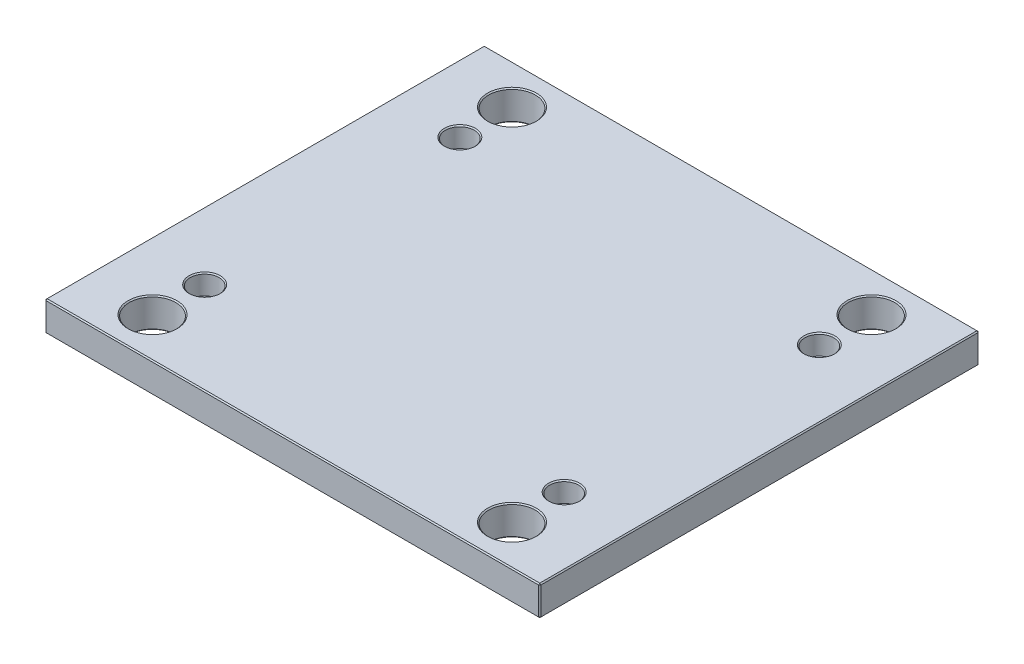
ISO-10303-21;
HEADER;
FILE_DESCRIPTION(('STEP AP214'),'2;1');
FILE_NAME('part.step','',(''),(''),'','','');
FILE_SCHEMA(('AUTOMOTIVE_DESIGN { 1 0 10303 214 1 1 1 1 }'));
ENDSEC;
DATA;
#1=APPLICATION_CONTEXT('core data for automotive mechanical design processes');
#2=APPLICATION_PROTOCOL_DEFINITION('international standard','automotive_design',2000,#1);
#3=PRODUCT_CONTEXT('',#1,'mechanical');
#4=PRODUCT('Part','Part','',(#3));
#5=PRODUCT_RELATED_PRODUCT_CATEGORY('part','',(#4));
#6=PRODUCT_DEFINITION_FORMATION('','',#4);
#7=PRODUCT_DEFINITION_CONTEXT('part definition',#1,'design');
#8=PRODUCT_DEFINITION('design','',#6,#7);
#9=PRODUCT_DEFINITION_SHAPE('','',#8);
#10=(LENGTH_UNIT() NAMED_UNIT(*) SI_UNIT(.MILLI.,.METRE.));
#11=(NAMED_UNIT(*) PLANE_ANGLE_UNIT() SI_UNIT($,.RADIAN.));
#12=(NAMED_UNIT(*) SI_UNIT($,.STERADIAN.) SOLID_ANGLE_UNIT());
#13=UNCERTAINTY_MEASURE_WITH_UNIT(LENGTH_MEASURE(1.E-05),#10,'distance_accuracy_value','');
#14=(GEOMETRIC_REPRESENTATION_CONTEXT(3) GLOBAL_UNCERTAINTY_ASSIGNED_CONTEXT((#13)) GLOBAL_UNIT_ASSIGNED_CONTEXT((#10,
#11,#12)) REPRESENTATION_CONTEXT('',''));
#15=CARTESIAN_POINT('',(0.,0.,0.));
#16=DIRECTION('',(0.,0.,1.));
#17=DIRECTION('',(1.,0.,0.));
#18=AXIS2_PLACEMENT_3D('',#15,#16,#17);
#19=CARTESIAN_POINT('',(-223.,27.,198.));
#20=DIRECTION('',(1.,0.,0.));
#21=DIRECTION('',(0.,0.,-1.));
#22=AXIS2_PLACEMENT_3D('',#19,#20,#21);
#23=PLANE('',#22);
#24=DIRECTION('',(0.,-1.,0.));
#25=VECTOR('',#24,1.);
#26=CARTESIAN_POINT('',(-223.,27.,-197.));
#27=LINE('',#26,#25);
#28=CARTESIAN_POINT('',(-223.,26.,-197.));
#29=VERTEX_POINT('',#28);
#30=CARTESIAN_POINT('',(-223.,1.,-197.));
#31=VERTEX_POINT('',#30);
#32=EDGE_CURVE('E115',#29,#31,#27,.T.);
#33=ORIENTED_EDGE('',*,*,#32,.T.);
#34=DIRECTION('',(0.,0.,1.));
#35=VECTOR('',#34,1.);
#36=CARTESIAN_POINT('',(-223.,1.,198.));
#37=LINE('',#36,#35);
#38=CARTESIAN_POINT('',(-223.,1.,197.));
#39=VERTEX_POINT('',#38);
#40=EDGE_CURVE('E111',#31,#39,#37,.T.);
#41=ORIENTED_EDGE('',*,*,#40,.T.);
#42=DIRECTION('',(0.,1.,0.));
#43=VECTOR('',#42,1.);
#44=CARTESIAN_POINT('',(-223.,27.,197.));
#45=LINE('',#44,#43);
#46=CARTESIAN_POINT('',(-223.,26.,197.));
#47=VERTEX_POINT('',#46);
#48=EDGE_CURVE('E104',#39,#47,#45,.T.);
#49=ORIENTED_EDGE('',*,*,#48,.T.);
#50=DIRECTION('',(0.,0.,-1.));
#51=VECTOR('',#50,1.);
#52=CARTESIAN_POINT('',(-223.,26.,-198.));
#53=LINE('',#52,#51);
#54=EDGE_CURVE('E108',#47,#29,#53,.T.);
#55=ORIENTED_EDGE('',*,*,#54,.T.);
#56=EDGE_LOOP('',(#33,#41,#49,#55));
#57=FACE_BOUND('',#56,.T.);
#58=ADVANCED_FACE('F16',(#57),#23,.F.);
#59=CARTESIAN_POINT('',(223.,27.,198.));
#60=DIRECTION('',(0.,0.,-1.));
#61=DIRECTION('',(-1.,0.,0.));
#62=AXIS2_PLACEMENT_3D('',#59,#60,#61);
#63=PLANE('',#62);
#64=DIRECTION('',(-1.,0.,0.));
#65=VECTOR('',#64,1.);
#66=CARTESIAN_POINT('',(-223.,26.,198.));
#67=LINE('',#66,#65);
#68=CARTESIAN_POINT('',(222.,26.,198.));
#69=VERTEX_POINT('',#68);
#70=CARTESIAN_POINT('',(-222.,26.,198.));
#71=VERTEX_POINT('',#70);
#72=EDGE_CURVE('E170',#69,#71,#67,.T.);
#73=ORIENTED_EDGE('',*,*,#72,.T.);
#74=DIRECTION('',(0.,-1.,0.));
#75=VECTOR('',#74,1.);
#76=CARTESIAN_POINT('',(-222.,27.,198.));
#77=LINE('',#76,#75);
#78=CARTESIAN_POINT('',(-222.,1.00000000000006,198.));
#79=VERTEX_POINT('',#78);
#80=EDGE_CURVE('E123',#71,#79,#77,.T.);
#81=ORIENTED_EDGE('',*,*,#80,.T.);
#82=DIRECTION('',(1.,0.,0.));
#83=VECTOR('',#82,1.);
#84=CARTESIAN_POINT('',(223.,1.00000000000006,198.));
#85=LINE('',#84,#83);
#86=CARTESIAN_POINT('',(222.,1.00000000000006,198.));
#87=VERTEX_POINT('',#86);
#88=EDGE_CURVE('E174',#79,#87,#85,.T.);
#89=ORIENTED_EDGE('',*,*,#88,.T.);
#90=DIRECTION('',(0.,1.,0.));
#91=VECTOR('',#90,1.);
#92=CARTESIAN_POINT('',(222.,27.,198.));
#93=LINE('',#92,#91);
#94=EDGE_CURVE('E172',#87,#69,#93,.T.);
#95=ORIENTED_EDGE('',*,*,#94,.T.);
#96=EDGE_LOOP('',(#73,#81,#89,#95));
#97=FACE_BOUND('',#96,.T.);
#98=ADVANCED_FACE('F413',(#97),#63,.F.);
#99=CARTESIAN_POINT('',(223.,27.,198.));
#100=DIRECTION('',(-1.,0.,0.));
#101=DIRECTION('',(0.,0.,1.));
#102=AXIS2_PLACEMENT_3D('',#99,#100,#101);
#103=PLANE('',#102);
#104=DIRECTION('',(0.,0.,-1.));
#105=VECTOR('',#104,1.);
#106=CARTESIAN_POINT('',(223.,1.00000000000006,198.));
#107=LINE('',#106,#105);
#108=CARTESIAN_POINT('',(223.,1.00000000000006,197.));
#109=VERTEX_POINT('',#108);
#110=CARTESIAN_POINT('',(223.,1.00000000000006,-197.));
#111=VERTEX_POINT('',#110);
#112=EDGE_CURVE('E165',#109,#111,#107,.T.);
#113=ORIENTED_EDGE('',*,*,#112,.T.);
#114=DIRECTION('',(0.,1.,0.));
#115=VECTOR('',#114,1.);
#116=CARTESIAN_POINT('',(223.,27.,-197.));
#117=LINE('',#116,#115);
#118=CARTESIAN_POINT('',(223.,26.,-197.));
#119=VERTEX_POINT('',#118);
#120=EDGE_CURVE('E167',#111,#119,#117,.T.);
#121=ORIENTED_EDGE('',*,*,#120,.T.);
#122=DIRECTION('',(0.,0.,1.));
#123=VECTOR('',#122,1.);
#124=CARTESIAN_POINT('',(223.,26.,198.));
#125=LINE('',#124,#123);
#126=CARTESIAN_POINT('',(223.,26.,197.));
#127=VERTEX_POINT('',#126);
#128=EDGE_CURVE('E161',#119,#127,#125,.T.);
#129=ORIENTED_EDGE('',*,*,#128,.T.);
#130=DIRECTION('',(0.,-1.,0.));
#131=VECTOR('',#130,1.);
#132=CARTESIAN_POINT('',(223.,27.,197.));
#133=LINE('',#132,#131);
#134=EDGE_CURVE('E163',#127,#109,#133,.T.);
#135=ORIENTED_EDGE('',*,*,#134,.T.);
#136=EDGE_LOOP('',(#113,#121,#129,#135));
#137=FACE_BOUND('',#136,.T.);
#138=ADVANCED_FACE('F406',(#137),#103,.F.);
#139=CARTESIAN_POINT('',(223.,27.,-198.));
#140=DIRECTION('',(0.,0.,1.));
#141=DIRECTION('',(1.,0.,0.));
#142=AXIS2_PLACEMENT_3D('',#139,#140,#141);
#143=PLANE('',#142);
#144=DIRECTION('',(0.,-1.,0.));
#145=VECTOR('',#144,1.);
#146=CARTESIAN_POINT('',(222.,27.,-198.));
#147=LINE('',#146,#145);
#148=CARTESIAN_POINT('',(222.,26.,-198.));
#149=VERTEX_POINT('',#148);
#150=CARTESIAN_POINT('',(222.,1.00000000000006,-198.));
#151=VERTEX_POINT('',#150);
#152=EDGE_CURVE('E154',#149,#151,#147,.T.);
#153=ORIENTED_EDGE('',*,*,#152,.T.);
#154=DIRECTION('',(-1.,0.,0.));
#155=VECTOR('',#154,1.);
#156=CARTESIAN_POINT('',(223.,1.00000000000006,-198.));
#157=LINE('',#156,#155);
#158=CARTESIAN_POINT('',(-222.,1.00000000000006,-198.));
#159=VERTEX_POINT('',#158);
#160=EDGE_CURVE('E159',#151,#159,#157,.T.);
#161=ORIENTED_EDGE('',*,*,#160,.T.);
#162=DIRECTION('',(0.,1.,0.));
#163=VECTOR('',#162,1.);
#164=CARTESIAN_POINT('',(-222.,27.,-198.));
#165=LINE('',#164,#163);
#166=CARTESIAN_POINT('',(-222.,26.,-198.));
#167=VERTEX_POINT('',#166);
#168=EDGE_CURVE('E156',#159,#167,#165,.T.);
#169=ORIENTED_EDGE('',*,*,#168,.T.);
#170=DIRECTION('',(1.,0.,0.));
#171=VECTOR('',#170,1.);
#172=CARTESIAN_POINT('',(223.,26.,-198.));
#173=LINE('',#172,#171);
#174=EDGE_CURVE('E152',#167,#149,#173,.T.);
#175=ORIENTED_EDGE('',*,*,#174,.T.);
#176=EDGE_LOOP('',(#153,#161,#169,#175));
#177=FACE_BOUND('',#176,.T.);
#178=ADVANCED_FACE('F431',(#177),#143,.F.);
#179=CARTESIAN_POINT('',(0.,27.,0.));
#180=DIRECTION('',(0.,1.,0.));
#181=DIRECTION('',(0.,0.,1.));
#182=AXIS2_PLACEMENT_3D('',#179,#180,#181);
#183=PLANE('',#182);
#184=CARTESIAN_POINT('',(-162.,27.,162.));
#185=DIRECTION('',(0.,1.,0.));
#186=DIRECTION('',(0.,0.,1.));
#187=AXIS2_PLACEMENT_3D('',#184,#185,#186);
#188=CIRCLE('',#187,22.);
#189=CARTESIAN_POINT('',(-162.,27.,184.));
#190=VERTEX_POINT('',#189);
#191=EDGE_CURVE('E317',#190,#190,#188,.F.);
#192=ORIENTED_EDGE('',*,*,#191,.T.);
#193=EDGE_LOOP('',(#192));
#194=FACE_BOUND('',#193,.T.);
#195=CARTESIAN_POINT('',(162.,27.,162.));
#196=DIRECTION('',(0.,1.,0.));
#197=DIRECTION('',(0.,0.,1.));
#198=AXIS2_PLACEMENT_3D('',#195,#196,#197);
#199=CIRCLE('',#198,22.);
#200=CARTESIAN_POINT('',(162.,27.,184.));
#201=VERTEX_POINT('',#200);
#202=EDGE_CURVE('E314',#201,#201,#199,.F.);
#203=ORIENTED_EDGE('',*,*,#202,.T.);
#204=EDGE_LOOP('',(#203));
#205=FACE_BOUND('',#204,.T.);
#206=CARTESIAN_POINT('',(162.,27.,-162.));
#207=DIRECTION('',(0.,1.,0.));
#208=DIRECTION('',(0.,0.,1.));
#209=AXIS2_PLACEMENT_3D('',#206,#207,#208);
#210=CIRCLE('',#209,22.);
#211=CARTESIAN_POINT('',(162.,27.,-140.));
#212=VERTEX_POINT('',#211);
#213=EDGE_CURVE('E311',#212,#212,#210,.F.);
#214=ORIENTED_EDGE('',*,*,#213,.T.);
#215=EDGE_LOOP('',(#214));
#216=FACE_BOUND('',#215,.T.);
#217=CARTESIAN_POINT('',(-162.,27.,-162.));
#218=DIRECTION('',(0.,1.,0.));
#219=DIRECTION('',(0.,0.,1.));
#220=AXIS2_PLACEMENT_3D('',#217,#218,#219);
#221=CIRCLE('',#220,22.);
#222=CARTESIAN_POINT('',(-162.,27.,-140.));
#223=VERTEX_POINT('',#222);
#224=EDGE_CURVE('E308',#223,#223,#221,.F.);
#225=ORIENTED_EDGE('',*,*,#224,.T.);
#226=EDGE_LOOP('',(#225));
#227=FACE_BOUND('',#226,.T.);
#228=CARTESIAN_POINT('',(-162.,27.,115.));
#229=DIRECTION('',(0.,1.,0.));
#230=DIRECTION('',(0.,0.,1.));
#231=AXIS2_PLACEMENT_3D('',#228,#229,#230);
#232=CIRCLE('',#231,14.);
#233=CARTESIAN_POINT('',(-162.,27.,129.));
#234=VERTEX_POINT('',#233);
#235=EDGE_CURVE('E290',#234,#234,#232,.F.);
#236=ORIENTED_EDGE('',*,*,#235,.T.);
#237=EDGE_LOOP('',(#236));
#238=FACE_BOUND('',#237,.T.);
#239=CARTESIAN_POINT('',(162.,27.,115.));
#240=DIRECTION('',(0.,1.,0.));
#241=DIRECTION('',(0.,0.,1.));
#242=AXIS2_PLACEMENT_3D('',#239,#240,#241);
#243=CIRCLE('',#242,14.);
#244=CARTESIAN_POINT('',(162.,27.,129.));
#245=VERTEX_POINT('',#244);
#246=EDGE_CURVE('E287',#245,#245,#243,.F.);
#247=ORIENTED_EDGE('',*,*,#246,.T.);
#248=EDGE_LOOP('',(#247));
#249=FACE_BOUND('',#248,.T.);
#250=CARTESIAN_POINT('',(162.,27.,-115.));
#251=DIRECTION('',(0.,1.,0.));
#252=DIRECTION('',(0.,0.,1.));
#253=AXIS2_PLACEMENT_3D('',#250,#251,#252);
#254=CIRCLE('',#253,14.);
#255=CARTESIAN_POINT('',(162.,27.,-101.));
#256=VERTEX_POINT('',#255);
#257=EDGE_CURVE('E284',#256,#256,#254,.F.);
#258=ORIENTED_EDGE('',*,*,#257,.T.);
#259=EDGE_LOOP('',(#258));
#260=FACE_BOUND('',#259,.T.);
#261=CARTESIAN_POINT('',(-162.,27.,-115.));
#262=DIRECTION('',(0.,1.,0.));
#263=DIRECTION('',(0.,0.,1.));
#264=AXIS2_PLACEMENT_3D('',#261,#262,#263);
#265=CIRCLE('',#264,14.);
#266=CARTESIAN_POINT('',(-162.,27.,-101.));
#267=VERTEX_POINT('',#266);
#268=EDGE_CURVE('E281',#267,#267,#265,.F.);
#269=ORIENTED_EDGE('',*,*,#268,.T.);
#270=EDGE_LOOP('',(#269));
#271=FACE_BOUND('',#270,.T.);
#272=DIRECTION('',(0.,0.,-1.));
#273=VECTOR('',#272,1.);
#274=CARTESIAN_POINT('',(222.,27.,-198.));
#275=LINE('',#274,#273);
#276=CARTESIAN_POINT('',(222.,27.,197.));
#277=VERTEX_POINT('',#276);
#278=CARTESIAN_POINT('',(222.,27.,-197.));
#279=VERTEX_POINT('',#278);
#280=EDGE_CURVE('E31',#277,#279,#275,.T.);
#281=ORIENTED_EDGE('',*,*,#280,.T.);
#282=DIRECTION('',(-1.,0.,0.));
#283=VECTOR('',#282,1.);
#284=CARTESIAN_POINT('',(-223.,27.,-197.));
#285=LINE('',#284,#283);
#286=CARTESIAN_POINT('',(-222.,27.,-197.));
#287=VERTEX_POINT('',#286);
#288=EDGE_CURVE('E190',#279,#287,#285,.T.);
#289=ORIENTED_EDGE('',*,*,#288,.T.);
#290=DIRECTION('',(0.,0.,1.));
#291=VECTOR('',#290,1.);
#292=CARTESIAN_POINT('',(-222.,27.,198.));
#293=LINE('',#292,#291);
#294=CARTESIAN_POINT('',(-222.,27.,197.));
#295=VERTEX_POINT('',#294);
#296=EDGE_CURVE('E186',#287,#295,#293,.T.);
#297=ORIENTED_EDGE('',*,*,#296,.T.);
#298=DIRECTION('',(1.,0.,0.));
#299=VECTOR('',#298,1.);
#300=CARTESIAN_POINT('',(223.,27.,197.));
#301=LINE('',#300,#299);
#302=EDGE_CURVE('E36',#295,#277,#301,.T.);
#303=ORIENTED_EDGE('',*,*,#302,.T.);
#304=EDGE_LOOP('',(#281,#289,#297,#303));
#305=FACE_BOUND('',#304,.T.);
#306=ADVANCED_FACE('F357',(#194,#205,#216,#227,#238,#249,#260,#271,#305),#183,.T.);
#307=CARTESIAN_POINT('',(0.,0.,0.));
#308=DIRECTION('',(0.,1.,0.));
#309=DIRECTION('',(0.,0.,1.));
#310=AXIS2_PLACEMENT_3D('',#307,#308,#309);
#311=PLANE('',#310);
#312=CARTESIAN_POINT('',(-162.,0.,162.));
#313=DIRECTION('',(0.,1.,0.));
#314=DIRECTION('',(0.,0.,1.));
#315=AXIS2_PLACEMENT_3D('',#312,#313,#314);
#316=CIRCLE('',#315,22.);
#317=CARTESIAN_POINT('',(-162.,0.,184.));
#318=VERTEX_POINT('',#317);
#319=EDGE_CURVE('E329',#318,#318,#316,.T.);
#320=ORIENTED_EDGE('',*,*,#319,.T.);
#321=EDGE_LOOP('',(#320));
#322=FACE_BOUND('',#321,.T.);
#323=CARTESIAN_POINT('',(162.,0.,162.));
#324=DIRECTION('',(0.,1.,0.));
#325=DIRECTION('',(0.,0.,1.));
#326=AXIS2_PLACEMENT_3D('',#323,#324,#325);
#327=CIRCLE('',#326,22.);
#328=CARTESIAN_POINT('',(162.,0.,184.));
#329=VERTEX_POINT('',#328);
#330=EDGE_CURVE('E326',#329,#329,#327,.T.);
#331=ORIENTED_EDGE('',*,*,#330,.T.);
#332=EDGE_LOOP('',(#331));
#333=FACE_BOUND('',#332,.T.);
#334=CARTESIAN_POINT('',(162.,0.,-162.));
#335=DIRECTION('',(0.,1.,0.));
#336=DIRECTION('',(0.,0.,1.));
#337=AXIS2_PLACEMENT_3D('',#334,#335,#336);
#338=CIRCLE('',#337,22.);
#339=CARTESIAN_POINT('',(162.,0.,-140.));
#340=VERTEX_POINT('',#339);
#341=EDGE_CURVE('E323',#340,#340,#338,.T.);
#342=ORIENTED_EDGE('',*,*,#341,.T.);
#343=EDGE_LOOP('',(#342));
#344=FACE_BOUND('',#343,.T.);
#345=CARTESIAN_POINT('',(-162.,0.,-162.));
#346=DIRECTION('',(0.,1.,0.));
#347=DIRECTION('',(0.,0.,1.));
#348=AXIS2_PLACEMENT_3D('',#345,#346,#347);
#349=CIRCLE('',#348,22.);
#350=CARTESIAN_POINT('',(-162.,0.,-140.));
#351=VERTEX_POINT('',#350);
#352=EDGE_CURVE('E320',#351,#351,#349,.T.);
#353=ORIENTED_EDGE('',*,*,#352,.T.);
#354=EDGE_LOOP('',(#353));
#355=FACE_BOUND('',#354,.T.);
#356=CARTESIAN_POINT('',(162.,0.,-115.));
#357=DIRECTION('',(0.,1.,0.));
#358=DIRECTION('',(0.,0.,1.));
#359=AXIS2_PLACEMENT_3D('',#356,#357,#358);
#360=CIRCLE('',#359,10.0000000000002);
#361=CARTESIAN_POINT('',(162.,0.,-105.));
#362=VERTEX_POINT('',#361);
#363=EDGE_CURVE('E263',#362,#362,#360,.T.);
#364=ORIENTED_EDGE('',*,*,#363,.T.);
#365=EDGE_LOOP('',(#364));
#366=FACE_BOUND('',#365,.T.);
#367=CARTESIAN_POINT('',(162.,0.,115.));
#368=DIRECTION('',(0.,1.,0.));
#369=DIRECTION('',(0.,0.,1.));
#370=AXIS2_PLACEMENT_3D('',#367,#368,#369);
#371=CIRCLE('',#370,10.0000000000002);
#372=CARTESIAN_POINT('',(162.,0.,125.));
#373=VERTEX_POINT('',#372);
#374=EDGE_CURVE('E260',#373,#373,#371,.T.);
#375=ORIENTED_EDGE('',*,*,#374,.T.);
#376=EDGE_LOOP('',(#375));
#377=FACE_BOUND('',#376,.T.);
#378=CARTESIAN_POINT('',(-162.,0.,115.));
#379=DIRECTION('',(0.,1.,0.));
#380=DIRECTION('',(0.,0.,1.));
#381=AXIS2_PLACEMENT_3D('',#378,#379,#380);
#382=CIRCLE('',#381,10.);
#383=CARTESIAN_POINT('',(-162.,0.,125.));
#384=VERTEX_POINT('',#383);
#385=EDGE_CURVE('E257',#384,#384,#382,.T.);
#386=ORIENTED_EDGE('',*,*,#385,.T.);
#387=EDGE_LOOP('',(#386));
#388=FACE_BOUND('',#387,.T.);
#389=CARTESIAN_POINT('',(-162.,0.,-115.));
#390=DIRECTION('',(0.,1.,0.));
#391=DIRECTION('',(0.,0.,1.));
#392=AXIS2_PLACEMENT_3D('',#389,#390,#391);
#393=CIRCLE('',#392,10.0000000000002);
#394=CARTESIAN_POINT('',(-162.,0.,-105.));
#395=VERTEX_POINT('',#394);
#396=EDGE_CURVE('E192',#395,#395,#393,.T.);
#397=ORIENTED_EDGE('',*,*,#396,.T.);
#398=EDGE_LOOP('',(#397));
#399=FACE_BOUND('',#398,.T.);
#400=DIRECTION('',(0.,0.,1.));
#401=VECTOR('',#400,1.);
#402=CARTESIAN_POINT('',(222.,0.,0.));
#403=LINE('',#402,#401);
#404=CARTESIAN_POINT('',(222.,0.,-197.));
#405=VERTEX_POINT('',#404);
#406=CARTESIAN_POINT('',(222.,0.,197.));
#407=VERTEX_POINT('',#406);
#408=EDGE_CURVE('E177',#405,#407,#403,.T.);
#409=ORIENTED_EDGE('',*,*,#408,.T.);
#410=DIRECTION('',(-1.,0.,0.));
#411=VECTOR('',#410,1.);
#412=CARTESIAN_POINT('',(0.,0.,197.));
#413=LINE('',#412,#411);
#414=CARTESIAN_POINT('',(-222.,0.,197.));
#415=VERTEX_POINT('',#414);
#416=EDGE_CURVE('E183',#407,#415,#413,.T.);
#417=ORIENTED_EDGE('',*,*,#416,.T.);
#418=DIRECTION('',(0.,0.,-1.));
#419=VECTOR('',#418,1.);
#420=CARTESIAN_POINT('',(-222.,0.,0.));
#421=LINE('',#420,#419);
#422=CARTESIAN_POINT('',(-222.,0.,-197.));
#423=VERTEX_POINT('',#422);
#424=EDGE_CURVE('E181',#415,#423,#421,.T.);
#425=ORIENTED_EDGE('',*,*,#424,.T.);
#426=DIRECTION('',(1.,0.,0.));
#427=VECTOR('',#426,1.);
#428=CARTESIAN_POINT('',(0.,0.,-197.));
#429=LINE('',#428,#427);
#430=EDGE_CURVE('E179',#423,#405,#429,.T.);
#431=ORIENTED_EDGE('',*,*,#430,.T.);
#432=EDGE_LOOP('',(#409,#417,#425,#431));
#433=FACE_BOUND('',#432,.T.);
#434=ADVANCED_FACE('F353',(#322,#333,#344,#355,#366,#377,#388,#399,#433),#311,.F.);
#435=CARTESIAN_POINT('',(223.,27.,197.));
#436=DIRECTION('',(-0.707106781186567,0.,-0.707106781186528));
#437=DIRECTION('',(0.,-1.,0.));
#438=AXIS2_PLACEMENT_3D('',#435,#436,#437);
#439=PLANE('',#438);
#440=DIRECTION('',(-0.707106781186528,0.,0.707106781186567));
#441=VECTOR('',#440,1.);
#442=CARTESIAN_POINT('',(222.,26.,198.));
#443=LINE('',#442,#441);
#444=EDGE_CURVE('E141',#69,#127,#443,.F.);
#445=ORIENTED_EDGE('',*,*,#444,.F.);
#446=ORIENTED_EDGE('',*,*,#94,.F.);
#447=DIRECTION('',(0.707106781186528,0.,-0.707106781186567));
#448=VECTOR('',#447,1.);
#449=CARTESIAN_POINT('',(222.,1.00000000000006,198.));
#450=LINE('',#449,#448);
#451=EDGE_CURVE('E144',#109,#87,#450,.F.);
#452=ORIENTED_EDGE('',*,*,#451,.F.);
#453=ORIENTED_EDGE('',*,*,#134,.F.);
#454=EDGE_LOOP('',(#445,#446,#452,#453));
#455=FACE_BOUND('',#454,.T.);
#456=ADVANCED_FACE('F356',(#455),#439,.F.);
#457=CARTESIAN_POINT('',(222.,26.,198.));
#458=DIRECTION('',(0.577350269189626,0.577350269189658,0.577350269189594));
#459=DIRECTION('',(-0.707106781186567,0.707106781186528,0.));
#460=AXIS2_PLACEMENT_3D('',#457,#458,#459);
#461=PLANE('',#460);
#462=DIRECTION('',(0.,-0.707106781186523,0.707106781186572));
#463=VECTOR('',#462,1.);
#464=CARTESIAN_POINT('',(222.,26.,198.));
#465=LINE('',#464,#463);
#466=EDGE_CURVE('E235',#69,#277,#465,.F.);
#467=ORIENTED_EDGE('',*,*,#466,.F.);
#468=ORIENTED_EDGE('',*,*,#444,.T.);
#469=DIRECTION('',(-0.707106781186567,0.707106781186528,0.));
#470=VECTOR('',#469,1.);
#471=CARTESIAN_POINT('',(222.5,26.5,197.));
#472=LINE('',#471,#470);
#473=EDGE_CURVE('E237',#277,#127,#472,.F.);
#474=ORIENTED_EDGE('',*,*,#473,.F.);
#475=EDGE_LOOP('',(#467,#468,#474));
#476=FACE_BOUND('',#475,.T.);
#477=ADVANCED_FACE('F419',(#476),#461,.T.);
#478=CARTESIAN_POINT('',(222.,1.00000000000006,198.));
#479=DIRECTION('',(0.577350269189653,-0.577350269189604,0.57735026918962));
#480=DIRECTION('',(0.707106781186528,0.,-0.707106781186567));
#481=AXIS2_PLACEMENT_3D('',#478,#479,#480);
#482=PLANE('',#481);
#483=DIRECTION('',(-0.707106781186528,-0.707106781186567,0.));
#484=VECTOR('',#483,1.);
#485=CARTESIAN_POINT('',(222.5,0.500000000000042,197.));
#486=LINE('',#485,#484);
#487=EDGE_CURVE('E229',#109,#407,#486,.T.);
#488=ORIENTED_EDGE('',*,*,#487,.F.);
#489=ORIENTED_EDGE('',*,*,#451,.T.);
#490=DIRECTION('',(0.,0.707106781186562,0.707106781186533));
#491=VECTOR('',#490,1.);
#492=CARTESIAN_POINT('',(222.,1.00000000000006,198.));
#493=LINE('',#492,#491);
#494=EDGE_CURVE('E232',#407,#87,#493,.T.);
#495=ORIENTED_EDGE('',*,*,#494,.F.);
#496=EDGE_LOOP('',(#488,#489,#495));
#497=FACE_BOUND('',#496,.T.);
#498=ADVANCED_FACE('F378',(#497),#482,.T.);
#499=CARTESIAN_POINT('',(222.,27.,0.));
#500=DIRECTION('',(0.707106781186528,0.707106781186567,0.));
#501=DIRECTION('',(0.,0.,1.));
#502=AXIS2_PLACEMENT_3D('',#499,#500,#501);
#503=PLANE('',#502);
#504=ORIENTED_EDGE('',*,*,#473,.T.);
#505=ORIENTED_EDGE('',*,*,#128,.F.);
#506=DIRECTION('',(0.707106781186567,-0.707106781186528,0.));
#507=VECTOR('',#506,1.);
#508=CARTESIAN_POINT('',(223.,26.,-197.));
#509=LINE('',#508,#507);
#510=EDGE_CURVE('E224',#279,#119,#509,.T.);
#511=ORIENTED_EDGE('',*,*,#510,.F.);
#512=ORIENTED_EDGE('',*,*,#280,.F.);
#513=EDGE_LOOP('',(#504,#505,#511,#512));
#514=FACE_BOUND('',#513,.T.);
#515=ADVANCED_FACE('F421',(#514),#503,.T.);
#516=CARTESIAN_POINT('',(0.,27.,197.));
#517=DIRECTION('',(0.,0.707106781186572,0.707106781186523));
#518=DIRECTION('',(-1.,0.,0.));
#519=AXIS2_PLACEMENT_3D('',#516,#517,#518);
#520=PLANE('',#519);
#521=ORIENTED_EDGE('',*,*,#466,.T.);
#522=ORIENTED_EDGE('',*,*,#302,.F.);
#523=DIRECTION('',(0.,0.707106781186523,-0.707106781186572));
#524=VECTOR('',#523,1.);
#525=CARTESIAN_POINT('',(-222.,26.5,197.5));
#526=LINE('',#525,#524);
#527=EDGE_CURVE('E127',#71,#295,#526,.T.);
#528=ORIENTED_EDGE('',*,*,#527,.F.);
#529=ORIENTED_EDGE('',*,*,#72,.F.);
#530=EDGE_LOOP('',(#521,#522,#528,#529));
#531=FACE_BOUND('',#530,.T.);
#532=ADVANCED_FACE('F416',(#531),#520,.T.);
#533=CARTESIAN_POINT('',(-222.,27.,198.));
#534=DIRECTION('',(0.707106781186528,0.,-0.707106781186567));
#535=DIRECTION('',(0.,-1.,0.));
#536=AXIS2_PLACEMENT_3D('',#533,#534,#535);
#537=PLANE('',#536);
#538=DIRECTION('',(0.707106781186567,0.,0.707106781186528));
#539=VECTOR('',#538,1.);
#540=CARTESIAN_POINT('',(-222.,1.00000000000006,198.));
#541=LINE('',#540,#539);
#542=EDGE_CURVE('E128',#79,#39,#541,.F.);
#543=ORIENTED_EDGE('',*,*,#542,.F.);
#544=ORIENTED_EDGE('',*,*,#80,.F.);
#545=DIRECTION('',(-0.707106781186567,0.,-0.707106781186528));
#546=VECTOR('',#545,1.);
#547=CARTESIAN_POINT('',(-223.,26.,197.));
#548=LINE('',#547,#546);
#549=EDGE_CURVE('E119',#47,#71,#548,.F.);
#550=ORIENTED_EDGE('',*,*,#549,.F.);
#551=ORIENTED_EDGE('',*,*,#48,.F.);
#552=EDGE_LOOP('',(#543,#544,#550,#551));
#553=FACE_BOUND('',#552,.T.);
#554=ADVANCED_FACE('F121',(#553),#537,.F.);
#555=CARTESIAN_POINT('',(223.,1.00000000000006,198.));
#556=DIRECTION('',(0.,0.707106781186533,-0.707106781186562));
#557=DIRECTION('',(1.,0.,0.));
#558=AXIS2_PLACEMENT_3D('',#555,#556,#557);
#559=PLANE('',#558);
#560=ORIENTED_EDGE('',*,*,#494,.T.);
#561=ORIENTED_EDGE('',*,*,#88,.F.);
#562=DIRECTION('',(0.,-0.707106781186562,-0.707106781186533));
#563=VECTOR('',#562,1.);
#564=CARTESIAN_POINT('',(-222.,1.00000000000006,198.));
#565=LINE('',#564,#563);
#566=EDGE_CURVE('E220',#415,#79,#565,.F.);
#567=ORIENTED_EDGE('',*,*,#566,.F.);
#568=ORIENTED_EDGE('',*,*,#416,.F.);
#569=EDGE_LOOP('',(#560,#561,#567,#568));
#570=FACE_BOUND('',#569,.T.);
#571=ADVANCED_FACE('F383',(#570),#559,.F.);
#572=CARTESIAN_POINT('',(223.,1.00000000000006,198.));
#573=DIRECTION('',(-0.707106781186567,0.707106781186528,0.));
#574=DIRECTION('',(0.,0.,-1.));
#575=AXIS2_PLACEMENT_3D('',#572,#573,#574);
#576=PLANE('',#575);
#577=ORIENTED_EDGE('',*,*,#487,.T.);
#578=ORIENTED_EDGE('',*,*,#408,.F.);
#579=DIRECTION('',(0.707106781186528,0.707106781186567,0.));
#580=VECTOR('',#579,1.);
#581=CARTESIAN_POINT('',(222.5,0.500000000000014,-197.));
#582=LINE('',#581,#580);
#583=EDGE_CURVE('E217',#111,#405,#582,.F.);
#584=ORIENTED_EDGE('',*,*,#583,.F.);
#585=ORIENTED_EDGE('',*,*,#112,.F.);
#586=EDGE_LOOP('',(#577,#578,#584,#585));
#587=FACE_BOUND('',#586,.T.);
#588=ADVANCED_FACE('F376',(#587),#576,.F.);
#589=CARTESIAN_POINT('',(222.,27.,-198.));
#590=DIRECTION('',(-0.707106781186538,0.,0.707106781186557));
#591=DIRECTION('',(0.,-1.,0.));
#592=AXIS2_PLACEMENT_3D('',#589,#590,#591);
#593=PLANE('',#592);
#594=DIRECTION('',(0.707106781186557,0.,0.707106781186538));
#595=VECTOR('',#594,1.);
#596=CARTESIAN_POINT('',(223.,26.,-197.));
#597=LINE('',#596,#595);
#598=EDGE_CURVE('E226',#119,#149,#597,.F.);
#599=ORIENTED_EDGE('',*,*,#598,.F.);
#600=ORIENTED_EDGE('',*,*,#120,.F.);
#601=DIRECTION('',(-0.707106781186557,0.,-0.707106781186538));
#602=VECTOR('',#601,1.);
#603=CARTESIAN_POINT('',(222.,1.00000000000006,-198.));
#604=LINE('',#603,#602);
#605=EDGE_CURVE('E214',#151,#111,#604,.F.);
#606=ORIENTED_EDGE('',*,*,#605,.F.);
#607=ORIENTED_EDGE('',*,*,#152,.F.);
#608=EDGE_LOOP('',(#599,#600,#606,#607));
#609=FACE_BOUND('',#608,.T.);
#610=ADVANCED_FACE('F403',(#609),#593,.F.);
#611=CARTESIAN_POINT('',(223.,26.,-197.));
#612=DIRECTION('',(0.577350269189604,0.577350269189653,-0.57735026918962));
#613=DIRECTION('',(0.,0.707106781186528,0.707106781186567));
#614=AXIS2_PLACEMENT_3D('',#611,#612,#613);
#615=PLANE('',#614);
#616=ORIENTED_EDGE('',*,*,#510,.T.);
#617=ORIENTED_EDGE('',*,*,#598,.T.);
#618=DIRECTION('',(0.,0.707106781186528,0.707106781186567));
#619=VECTOR('',#618,1.);
#620=CARTESIAN_POINT('',(222.,26.5,-197.5));
#621=LINE('',#620,#619);
#622=EDGE_CURVE('E135',#279,#149,#621,.F.);
#623=ORIENTED_EDGE('',*,*,#622,.F.);
#624=EDGE_LOOP('',(#616,#617,#623));
#625=FACE_BOUND('',#624,.T.);
#626=ADVANCED_FACE('F425',(#625),#615,.T.);
#627=CARTESIAN_POINT('',(-223.,26.,197.));
#628=DIRECTION('',(-0.577350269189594,0.577350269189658,0.577350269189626));
#629=DIRECTION('',(0.,-0.707106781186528,0.707106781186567));
#630=AXIS2_PLACEMENT_3D('',#627,#628,#629);
#631=PLANE('',#630);
#632=ORIENTED_EDGE('',*,*,#549,.T.);
#633=ORIENTED_EDGE('',*,*,#527,.T.);
#634=DIRECTION('',(-0.707106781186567,-0.707106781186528,0.));
#635=VECTOR('',#634,1.);
#636=CARTESIAN_POINT('',(-223.,26.,197.));
#637=LINE('',#636,#635);
#638=EDGE_CURVE('E131',#47,#295,#637,.F.);
#639=ORIENTED_EDGE('',*,*,#638,.F.);
#640=EDGE_LOOP('',(#632,#633,#639));
#641=FACE_BOUND('',#640,.T.);
#642=ADVANCED_FACE('F132',(#641),#631,.T.);
#643=CARTESIAN_POINT('',(-222.,1.00000000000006,198.));
#644=DIRECTION('',(-0.577350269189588,-0.577350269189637,0.577350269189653));
#645=DIRECTION('',(0.,-0.707106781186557,-0.707106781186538));
#646=AXIS2_PLACEMENT_3D('',#643,#644,#645);
#647=PLANE('',#646);
#648=ORIENTED_EDGE('',*,*,#566,.T.);
#649=ORIENTED_EDGE('',*,*,#542,.T.);
#650=DIRECTION('',(-0.707106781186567,0.707106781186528,0.));
#651=VECTOR('',#650,1.);
#652=CARTESIAN_POINT('',(-222.5,0.500000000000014,197.));
#653=LINE('',#652,#651);
#654=EDGE_CURVE('E136',#415,#39,#653,.T.);
#655=ORIENTED_EDGE('',*,*,#654,.F.);
#656=EDGE_LOOP('',(#648,#649,#655));
#657=FACE_BOUND('',#656,.T.);
#658=ADVANCED_FACE('F386',(#657),#647,.T.);
#659=CARTESIAN_POINT('',(222.,1.00000000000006,-198.));
#660=DIRECTION('',(0.577350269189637,-0.577350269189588,-0.577350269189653));
#661=DIRECTION('',(-0.707106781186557,0.,-0.707106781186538));
#662=AXIS2_PLACEMENT_3D('',#659,#660,#661);
#663=PLANE('',#662);
#664=ORIENTED_EDGE('',*,*,#605,.T.);
#665=ORIENTED_EDGE('',*,*,#583,.T.);
#666=DIRECTION('',(0.,-0.707106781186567,0.707106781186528));
#667=VECTOR('',#666,1.);
#668=CARTESIAN_POINT('',(222.,1.00000000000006,-198.));
#669=LINE('',#668,#667);
#670=EDGE_CURVE('E207',#151,#405,#669,.T.);
#671=ORIENTED_EDGE('',*,*,#670,.F.);
#672=EDGE_LOOP('',(#664,#665,#671));
#673=FACE_BOUND('',#672,.T.);
#674=ADVANCED_FACE('F397',(#673),#663,.T.);
#675=CARTESIAN_POINT('',(0.,27.,-197.));
#676=DIRECTION('',(0.,0.707106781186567,-0.707106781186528));
#677=DIRECTION('',(1.,0.,0.));
#678=AXIS2_PLACEMENT_3D('',#675,#676,#677);
#679=PLANE('',#678);
#680=ORIENTED_EDGE('',*,*,#622,.T.);
#681=ORIENTED_EDGE('',*,*,#174,.F.);
#682=DIRECTION('',(0.,-0.707106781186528,-0.707106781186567));
#683=VECTOR('',#682,1.);
#684=CARTESIAN_POINT('',(-222.,26.,-198.));
#685=LINE('',#684,#683);
#686=EDGE_CURVE('E204',#287,#167,#685,.T.);
#687=ORIENTED_EDGE('',*,*,#686,.F.);
#688=ORIENTED_EDGE('',*,*,#288,.F.);
#689=EDGE_LOOP('',(#680,#681,#687,#688));
#690=FACE_BOUND('',#689,.T.);
#691=ADVANCED_FACE('F429',(#690),#679,.T.);
#692=CARTESIAN_POINT('',(-222.,27.,0.));
#693=DIRECTION('',(-0.707106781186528,0.707106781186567,0.));
#694=DIRECTION('',(0.,0.,-1.));
#695=AXIS2_PLACEMENT_3D('',#692,#693,#694);
#696=PLANE('',#695);
#697=ORIENTED_EDGE('',*,*,#638,.T.);
#698=ORIENTED_EDGE('',*,*,#296,.F.);
#699=DIRECTION('',(0.707106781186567,0.707106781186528,0.));
#700=VECTOR('',#699,1.);
#701=CARTESIAN_POINT('',(-222.5,26.5,-197.));
#702=LINE('',#701,#700);
#703=EDGE_CURVE('E139',#29,#287,#702,.T.);
#704=ORIENTED_EDGE('',*,*,#703,.F.);
#705=ORIENTED_EDGE('',*,*,#54,.F.);
#706=EDGE_LOOP('',(#697,#698,#704,#705));
#707=FACE_BOUND('',#706,.T.);
#708=ADVANCED_FACE('F138',(#707),#696,.T.);
#709=CARTESIAN_POINT('',(-223.,1.,198.));
#710=DIRECTION('',(0.707106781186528,0.707106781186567,0.));
#711=DIRECTION('',(0.,0.,1.));
#712=AXIS2_PLACEMENT_3D('',#709,#710,#711);
#713=PLANE('',#712);
#714=ORIENTED_EDGE('',*,*,#654,.T.);
#715=ORIENTED_EDGE('',*,*,#40,.F.);
#716=DIRECTION('',(0.707106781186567,-0.707106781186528,0.));
#717=VECTOR('',#716,1.);
#718=CARTESIAN_POINT('',(-223.,1.,-197.));
#719=LINE('',#718,#717);
#720=EDGE_CURVE('E200',#423,#31,#719,.F.);
#721=ORIENTED_EDGE('',*,*,#720,.F.);
#722=ORIENTED_EDGE('',*,*,#424,.F.);
#723=EDGE_LOOP('',(#714,#715,#721,#722));
#724=FACE_BOUND('',#723,.T.);
#725=ADVANCED_FACE('F388',(#724),#713,.F.);
#726=CARTESIAN_POINT('',(223.,1.00000000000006,-198.));
#727=DIRECTION('',(0.,0.707106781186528,0.707106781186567));
#728=DIRECTION('',(-1.,0.,0.));
#729=AXIS2_PLACEMENT_3D('',#726,#727,#728);
#730=PLANE('',#729);
#731=ORIENTED_EDGE('',*,*,#670,.T.);
#732=ORIENTED_EDGE('',*,*,#430,.F.);
#733=DIRECTION('',(0.,0.707106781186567,-0.707106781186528));
#734=VECTOR('',#733,1.);
#735=CARTESIAN_POINT('',(-222.,0.500000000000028,-197.5));
#736=LINE('',#735,#734);
#737=EDGE_CURVE('E197',#159,#423,#736,.F.);
#738=ORIENTED_EDGE('',*,*,#737,.F.);
#739=ORIENTED_EDGE('',*,*,#160,.F.);
#740=EDGE_LOOP('',(#731,#732,#738,#739));
#741=FACE_BOUND('',#740,.T.);
#742=ADVANCED_FACE('F392',(#741),#730,.F.);
#743=CARTESIAN_POINT('',(-222.,26.,-198.));
#744=DIRECTION('',(-0.577350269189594,0.577350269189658,-0.577350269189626));
#745=DIRECTION('',(0.,0.707106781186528,0.707106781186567));
#746=AXIS2_PLACEMENT_3D('',#743,#744,#745);
#747=PLANE('',#746);
#748=ORIENTED_EDGE('',*,*,#703,.T.);
#749=ORIENTED_EDGE('',*,*,#686,.T.);
#750=DIRECTION('',(0.707106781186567,0.,-0.707106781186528));
#751=VECTOR('',#750,1.);
#752=CARTESIAN_POINT('',(-222.,26.,-198.));
#753=LINE('',#752,#751);
#754=EDGE_CURVE('E195',#29,#167,#753,.T.);
#755=ORIENTED_EDGE('',*,*,#754,.F.);
#756=EDGE_LOOP('',(#748,#749,#755));
#757=FACE_BOUND('',#756,.T.);
#758=ADVANCED_FACE('F460',(#757),#747,.T.);
#759=CARTESIAN_POINT('',(-223.,1.,-197.));
#760=DIRECTION('',(-0.577350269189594,-0.577350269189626,-0.577350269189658));
#761=DIRECTION('',(0.,0.707106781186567,-0.707106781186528));
#762=AXIS2_PLACEMENT_3D('',#759,#760,#761);
#763=PLANE('',#762);
#764=ORIENTED_EDGE('',*,*,#737,.T.);
#765=ORIENTED_EDGE('',*,*,#720,.T.);
#766=DIRECTION('',(-0.707106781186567,0.,0.707106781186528));
#767=VECTOR('',#766,1.);
#768=CARTESIAN_POINT('',(-223.,1.,-197.));
#769=LINE('',#768,#767);
#770=EDGE_CURVE('E193',#159,#31,#769,.T.);
#771=ORIENTED_EDGE('',*,*,#770,.F.);
#772=EDGE_LOOP('',(#764,#765,#771));
#773=FACE_BOUND('',#772,.T.);
#774=ADVANCED_FACE('F456',(#773),#763,.T.);
#775=CARTESIAN_POINT('',(-223.,27.,-197.));
#776=DIRECTION('',(0.707106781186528,0.,0.707106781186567));
#777=DIRECTION('',(0.,-1.,0.));
#778=AXIS2_PLACEMENT_3D('',#775,#776,#777);
#779=PLANE('',#778);
#780=ORIENTED_EDGE('',*,*,#754,.T.);
#781=ORIENTED_EDGE('',*,*,#168,.F.);
#782=ORIENTED_EDGE('',*,*,#770,.T.);
#783=ORIENTED_EDGE('',*,*,#32,.F.);
#784=EDGE_LOOP('',(#780,#781,#782,#783));
#785=FACE_BOUND('',#784,.T.);
#786=ADVANCED_FACE('F452',(#785),#779,.F.);
#787=CARTESIAN_POINT('',(-162.,9.,-115.));
#788=DIRECTION('',(0.,1.,0.));
#789=DIRECTION('',(0.,0.,1.));
#790=AXIS2_PLACEMENT_3D('',#787,#788,#789);
#791=CYLINDRICAL_SURFACE('',#790,13.);
#792=CARTESIAN_POINT('',(-162.,26.,-115.));
#793=DIRECTION('',(0.,1.,0.));
#794=DIRECTION('',(0.,0.,1.));
#795=AXIS2_PLACEMENT_3D('',#792,#793,#794);
#796=CIRCLE('',#795,13.);
#797=CARTESIAN_POINT('',(-162.,26.,-102.));
#798=VERTEX_POINT('',#797);
#799=EDGE_CURVE('E299',#798,#798,#796,.T.);
#800=ORIENTED_EDGE('',*,*,#799,.T.);
#801=EDGE_LOOP('',(#800));
#802=FACE_BOUND('',#801,.T.);
#803=CARTESIAN_POINT('',(-162.,9.,-115.));
#804=DIRECTION('',(0.,1.,0.));
#805=DIRECTION('',(0.,0.,1.));
#806=AXIS2_PLACEMENT_3D('',#803,#804,#805);
#807=CIRCLE('',#806,13.);
#808=CARTESIAN_POINT('',(-162.,9.,-102.));
#809=VERTEX_POINT('',#808);
#810=EDGE_CURVE('E147',#809,#809,#807,.T.);
#811=ORIENTED_EDGE('',*,*,#810,.F.);
#812=EDGE_LOOP('',(#811));
#813=FACE_BOUND('',#812,.T.);
#814=ADVANCED_FACE('F455',(#802,#813),#791,.F.);
#815=CARTESIAN_POINT('',(-162.,9.,-115.));
#816=DIRECTION('',(0.,1.,0.));
#817=DIRECTION('',(0.,0.,1.));
#818=AXIS2_PLACEMENT_3D('',#815,#816,#817);
#819=PLANE('',#818);
#820=CARTESIAN_POINT('',(-162.,9.,-115.));
#821=DIRECTION('',(0.,1.,0.));
#822=DIRECTION('',(0.,0.,1.));
#823=AXIS2_PLACEMENT_3D('',#820,#821,#822);
#824=CIRCLE('',#823,9.);
#825=CARTESIAN_POINT('',(-162.,9.,-106.));
#826=VERTEX_POINT('',#825);
#827=EDGE_CURVE('E251',#826,#826,#824,.T.);
#828=ORIENTED_EDGE('',*,*,#827,.F.);
#829=EDGE_LOOP('',(#828));
#830=FACE_BOUND('',#829,.T.);
#831=ORIENTED_EDGE('',*,*,#810,.T.);
#832=EDGE_LOOP('',(#831));
#833=FACE_BOUND('',#832,.T.);
#834=ADVANCED_FACE('F602',(#830,#833),#819,.T.);
#835=CARTESIAN_POINT('',(162.,9.,-115.));
#836=DIRECTION('',(0.,1.,0.));
#837=DIRECTION('',(0.,0.,1.));
#838=AXIS2_PLACEMENT_3D('',#835,#836,#837);
#839=CYLINDRICAL_SURFACE('',#838,13.);
#840=CARTESIAN_POINT('',(162.,26.,-115.));
#841=DIRECTION('',(0.,1.,0.));
#842=DIRECTION('',(0.,0.,1.));
#843=AXIS2_PLACEMENT_3D('',#840,#841,#842);
#844=CIRCLE('',#843,13.);
#845=CARTESIAN_POINT('',(162.,26.,-102.));
#846=VERTEX_POINT('',#845);
#847=EDGE_CURVE('E296',#846,#846,#844,.T.);
#848=ORIENTED_EDGE('',*,*,#847,.T.);
#849=EDGE_LOOP('',(#848));
#850=FACE_BOUND('',#849,.T.);
#851=CARTESIAN_POINT('',(162.,9.,-115.));
#852=DIRECTION('',(0.,1.,0.));
#853=DIRECTION('',(0.,0.,1.));
#854=AXIS2_PLACEMENT_3D('',#851,#852,#853);
#855=CIRCLE('',#854,13.);
#856=CARTESIAN_POINT('',(162.,9.,-102.));
#857=VERTEX_POINT('',#856);
#858=EDGE_CURVE('E630',#857,#857,#855,.T.);
#859=ORIENTED_EDGE('',*,*,#858,.F.);
#860=EDGE_LOOP('',(#859));
#861=FACE_BOUND('',#860,.T.);
#862=ADVANCED_FACE('F598',(#850,#861),#839,.F.);
#863=CARTESIAN_POINT('',(162.,9.,-115.));
#864=DIRECTION('',(0.,1.,0.));
#865=DIRECTION('',(0.,0.,1.));
#866=AXIS2_PLACEMENT_3D('',#863,#864,#865);
#867=PLANE('',#866);
#868=CARTESIAN_POINT('',(162.,9.,-115.));
#869=DIRECTION('',(0.,1.,0.));
#870=DIRECTION('',(0.,0.,1.));
#871=AXIS2_PLACEMENT_3D('',#868,#869,#870);
#872=CIRCLE('',#871,9.);
#873=CARTESIAN_POINT('',(162.,9.,-106.));
#874=VERTEX_POINT('',#873);
#875=EDGE_CURVE('E248',#874,#874,#872,.T.);
#876=ORIENTED_EDGE('',*,*,#875,.F.);
#877=EDGE_LOOP('',(#876));
#878=FACE_BOUND('',#877,.T.);
#879=ORIENTED_EDGE('',*,*,#858,.T.);
#880=EDGE_LOOP('',(#879));
#881=FACE_BOUND('',#880,.T.);
#882=ADVANCED_FACE('F594',(#878,#881),#867,.T.);
#883=CARTESIAN_POINT('',(162.,9.,115.));
#884=DIRECTION('',(0.,1.,0.));
#885=DIRECTION('',(0.,0.,1.));
#886=AXIS2_PLACEMENT_3D('',#883,#884,#885);
#887=CYLINDRICAL_SURFACE('',#886,13.);
#888=CARTESIAN_POINT('',(162.,26.,115.));
#889=DIRECTION('',(0.,1.,0.));
#890=DIRECTION('',(0.,0.,1.));
#891=AXIS2_PLACEMENT_3D('',#888,#889,#890);
#892=CIRCLE('',#891,13.);
#893=CARTESIAN_POINT('',(162.,26.,128.));
#894=VERTEX_POINT('',#893);
#895=EDGE_CURVE('E293',#894,#894,#892,.T.);
#896=ORIENTED_EDGE('',*,*,#895,.T.);
#897=EDGE_LOOP('',(#896));
#898=FACE_BOUND('',#897,.T.);
#899=CARTESIAN_POINT('',(162.,9.,115.));
#900=DIRECTION('',(0.,1.,0.));
#901=DIRECTION('',(0.,0.,1.));
#902=AXIS2_PLACEMENT_3D('',#899,#900,#901);
#903=CIRCLE('',#902,13.);
#904=CARTESIAN_POINT('',(162.,9.,128.));
#905=VERTEX_POINT('',#904);
#906=EDGE_CURVE('E632',#905,#905,#903,.T.);
#907=ORIENTED_EDGE('',*,*,#906,.F.);
#908=EDGE_LOOP('',(#907));
#909=FACE_BOUND('',#908,.T.);
#910=ADVANCED_FACE('F597',(#898,#909),#887,.F.);
#911=CARTESIAN_POINT('',(162.,9.,115.));
#912=DIRECTION('',(0.,1.,0.));
#913=DIRECTION('',(0.,0.,1.));
#914=AXIS2_PLACEMENT_3D('',#911,#912,#913);
#915=PLANE('',#914);
#916=CARTESIAN_POINT('',(162.,9.,115.));
#917=DIRECTION('',(0.,1.,0.));
#918=DIRECTION('',(0.,0.,1.));
#919=AXIS2_PLACEMENT_3D('',#916,#917,#918);
#920=CIRCLE('',#919,9.);
#921=CARTESIAN_POINT('',(162.,9.,124.));
#922=VERTEX_POINT('',#921);
#923=EDGE_CURVE('E245',#922,#922,#920,.T.);
#924=ORIENTED_EDGE('',*,*,#923,.F.);
#925=EDGE_LOOP('',(#924));
#926=FACE_BOUND('',#925,.T.);
#927=ORIENTED_EDGE('',*,*,#906,.T.);
#928=EDGE_LOOP('',(#927));
#929=FACE_BOUND('',#928,.T.);
#930=ADVANCED_FACE('F604',(#926,#929),#915,.T.);
#931=CARTESIAN_POINT('',(-162.,9.,115.));
#932=DIRECTION('',(0.,1.,0.));
#933=DIRECTION('',(0.,0.,1.));
#934=AXIS2_PLACEMENT_3D('',#931,#932,#933);
#935=CYLINDRICAL_SURFACE('',#934,13.);
#936=CARTESIAN_POINT('',(-162.,26.,115.));
#937=DIRECTION('',(0.,1.,0.));
#938=DIRECTION('',(0.,0.,1.));
#939=AXIS2_PLACEMENT_3D('',#936,#937,#938);
#940=CIRCLE('',#939,13.);
#941=CARTESIAN_POINT('',(-162.,26.,128.));
#942=VERTEX_POINT('',#941);
#943=EDGE_CURVE('E278',#942,#942,#940,.T.);
#944=ORIENTED_EDGE('',*,*,#943,.T.);
#945=EDGE_LOOP('',(#944));
#946=FACE_BOUND('',#945,.T.);
#947=CARTESIAN_POINT('',(-162.,9.,115.));
#948=DIRECTION('',(0.,1.,0.));
#949=DIRECTION('',(0.,0.,1.));
#950=AXIS2_PLACEMENT_3D('',#947,#948,#949);
#951=CIRCLE('',#950,13.);
#952=CARTESIAN_POINT('',(-162.,9.,128.));
#953=VERTEX_POINT('',#952);
#954=EDGE_CURVE('E254',#953,#953,#951,.T.);
#955=ORIENTED_EDGE('',*,*,#954,.F.);
#956=EDGE_LOOP('',(#955));
#957=FACE_BOUND('',#956,.T.);
#958=ADVANCED_FACE('F607',(#946,#957),#935,.F.);
#959=CARTESIAN_POINT('',(-162.,9.,115.));
#960=DIRECTION('',(0.,1.,0.));
#961=DIRECTION('',(0.,0.,1.));
#962=AXIS2_PLACEMENT_3D('',#959,#960,#961);
#963=PLANE('',#962);
#964=CARTESIAN_POINT('',(-162.,9.,115.));
#965=DIRECTION('',(0.,1.,0.));
#966=DIRECTION('',(0.,0.,1.));
#967=AXIS2_PLACEMENT_3D('',#964,#965,#966);
#968=CIRCLE('',#967,9.);
#969=CARTESIAN_POINT('',(-162.,9.,124.));
#970=VERTEX_POINT('',#969);
#971=EDGE_CURVE('E242',#970,#970,#968,.T.);
#972=ORIENTED_EDGE('',*,*,#971,.F.);
#973=EDGE_LOOP('',(#972));
#974=FACE_BOUND('',#973,.T.);
#975=ORIENTED_EDGE('',*,*,#954,.T.);
#976=EDGE_LOOP('',(#975));
#977=FACE_BOUND('',#976,.T.);
#978=ADVANCED_FACE('F589',(#974,#977),#963,.T.);
#979=CARTESIAN_POINT('',(-162.,0.,115.));
#980=DIRECTION('',(0.,1.,0.));
#981=DIRECTION('',(0.,0.,1.));
#982=AXIS2_PLACEMENT_3D('',#979,#980,#981);
#983=CYLINDRICAL_SURFACE('',#982,9.);
#984=CARTESIAN_POINT('',(-162.,0.999999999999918,115.));
#985=DIRECTION('',(0.,1.,0.));
#986=DIRECTION('',(0.,0.,1.));
#987=AXIS2_PLACEMENT_3D('',#984,#985,#986);
#988=CIRCLE('',#987,9.);
#989=CARTESIAN_POINT('',(-162.,0.999999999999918,124.));
#990=VERTEX_POINT('',#989);
#991=EDGE_CURVE('E272',#990,#990,#988,.F.);
#992=ORIENTED_EDGE('',*,*,#991,.T.);
#993=EDGE_LOOP('',(#992));
#994=FACE_BOUND('',#993,.T.);
#995=ORIENTED_EDGE('',*,*,#971,.T.);
#996=EDGE_LOOP('',(#995));
#997=FACE_BOUND('',#996,.T.);
#998=ADVANCED_FACE('F585',(#994,#997),#983,.F.);
#999=CARTESIAN_POINT('',(162.,0.,115.));
#1000=DIRECTION('',(0.,1.,0.));
#1001=DIRECTION('',(0.,0.,1.));
#1002=AXIS2_PLACEMENT_3D('',#999,#1000,#1001);
#1003=CYLINDRICAL_SURFACE('',#1002,9.);
#1004=CARTESIAN_POINT('',(162.,1.00000000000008,115.));
#1005=DIRECTION('',(0.,1.,0.));
#1006=DIRECTION('',(0.,0.,1.));
#1007=AXIS2_PLACEMENT_3D('',#1004,#1005,#1006);
#1008=CIRCLE('',#1007,9.);
#1009=CARTESIAN_POINT('',(162.,1.00000000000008,124.));
#1010=VERTEX_POINT('',#1009);
#1011=EDGE_CURVE('E269',#1010,#1010,#1008,.F.);
#1012=ORIENTED_EDGE('',*,*,#1011,.T.);
#1013=EDGE_LOOP('',(#1012));
#1014=FACE_BOUND('',#1013,.T.);
#1015=ORIENTED_EDGE('',*,*,#923,.T.);
#1016=EDGE_LOOP('',(#1015));
#1017=FACE_BOUND('',#1016,.T.);
#1018=ADVANCED_FACE('F581',(#1014,#1017),#1003,.F.);
#1019=CARTESIAN_POINT('',(162.,0.,-115.));
#1020=DIRECTION('',(0.,1.,0.));
#1021=DIRECTION('',(0.,0.,1.));
#1022=AXIS2_PLACEMENT_3D('',#1019,#1020,#1021);
#1023=CYLINDRICAL_SURFACE('',#1022,9.);
#1024=CARTESIAN_POINT('',(162.,1.00000000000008,-115.));
#1025=DIRECTION('',(0.,1.,0.));
#1026=DIRECTION('',(0.,0.,1.));
#1027=AXIS2_PLACEMENT_3D('',#1024,#1025,#1026);
#1028=CIRCLE('',#1027,9.);
#1029=CARTESIAN_POINT('',(162.,1.00000000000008,-106.));
#1030=VERTEX_POINT('',#1029);
#1031=EDGE_CURVE('E266',#1030,#1030,#1028,.F.);
#1032=ORIENTED_EDGE('',*,*,#1031,.T.);
#1033=EDGE_LOOP('',(#1032));
#1034=FACE_BOUND('',#1033,.T.);
#1035=ORIENTED_EDGE('',*,*,#875,.T.);
#1036=EDGE_LOOP('',(#1035));
#1037=FACE_BOUND('',#1036,.T.);
#1038=ADVANCED_FACE('F578',(#1034,#1037),#1023,.F.);
#1039=CARTESIAN_POINT('',(-162.,0.,-115.));
#1040=DIRECTION('',(0.,1.,0.));
#1041=DIRECTION('',(0.,0.,1.));
#1042=AXIS2_PLACEMENT_3D('',#1039,#1040,#1041);
#1043=CYLINDRICAL_SURFACE('',#1042,9.);
#1044=CARTESIAN_POINT('',(-162.,1.00000000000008,-115.));
#1045=DIRECTION('',(0.,1.,0.));
#1046=DIRECTION('',(0.,0.,1.));
#1047=AXIS2_PLACEMENT_3D('',#1044,#1045,#1046);
#1048=CIRCLE('',#1047,9.);
#1049=CARTESIAN_POINT('',(-162.,1.00000000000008,-106.));
#1050=VERTEX_POINT('',#1049);
#1051=EDGE_CURVE('E275',#1050,#1050,#1048,.F.);
#1052=ORIENTED_EDGE('',*,*,#1051,.T.);
#1053=EDGE_LOOP('',(#1052));
#1054=FACE_BOUND('',#1053,.T.);
#1055=ORIENTED_EDGE('',*,*,#827,.T.);
#1056=EDGE_LOOP('',(#1055));
#1057=FACE_BOUND('',#1056,.T.);
#1058=ADVANCED_FACE('F503',(#1054,#1057),#1043,.F.);
#1059=CARTESIAN_POINT('',(162.,0.,-115.));
#1060=DIRECTION('',(0.,-1.,0.));
#1061=DIRECTION('',(0.,0.,-1.));
#1062=AXIS2_PLACEMENT_3D('',#1059,#1060,#1061);
#1063=CONICAL_SURFACE('',#1062,10.0000000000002,0.785398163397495);
#1064=ORIENTED_EDGE('',*,*,#1031,.F.);
#1065=EDGE_LOOP('',(#1064));
#1066=FACE_BOUND('',#1065,.T.);
#1067=ORIENTED_EDGE('',*,*,#363,.F.);
#1068=EDGE_LOOP('',(#1067));
#1069=FACE_BOUND('',#1068,.T.);
#1070=ADVANCED_FACE('F499',(#1066,#1069),#1063,.F.);
#1071=CARTESIAN_POINT('',(162.,0.,115.));
#1072=DIRECTION('',(0.,-1.,0.));
#1073=DIRECTION('',(0.,0.,-1.));
#1074=AXIS2_PLACEMENT_3D('',#1071,#1072,#1073);
#1075=CONICAL_SURFACE('',#1074,10.0000000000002,0.785398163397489);
#1076=ORIENTED_EDGE('',*,*,#1011,.F.);
#1077=EDGE_LOOP('',(#1076));
#1078=FACE_BOUND('',#1077,.T.);
#1079=ORIENTED_EDGE('',*,*,#374,.F.);
#1080=EDGE_LOOP('',(#1079));
#1081=FACE_BOUND('',#1080,.T.);
#1082=ADVANCED_FACE('F502',(#1078,#1081),#1075,.F.);
#1083=CARTESIAN_POINT('',(-162.,0.,115.));
#1084=DIRECTION('',(0.,-1.,0.));
#1085=DIRECTION('',(0.,0.,-1.));
#1086=AXIS2_PLACEMENT_3D('',#1083,#1084,#1085);
#1087=CONICAL_SURFACE('',#1086,10.,0.785398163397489);
#1088=ORIENTED_EDGE('',*,*,#991,.F.);
#1089=EDGE_LOOP('',(#1088));
#1090=FACE_BOUND('',#1089,.T.);
#1091=ORIENTED_EDGE('',*,*,#385,.F.);
#1092=EDGE_LOOP('',(#1091));
#1093=FACE_BOUND('',#1092,.T.);
#1094=ADVANCED_FACE('F507',(#1090,#1093),#1087,.F.);
#1095=CARTESIAN_POINT('',(-162.,0.,-115.));
#1096=DIRECTION('',(0.,-1.,0.));
#1097=DIRECTION('',(0.,0.,-1.));
#1098=AXIS2_PLACEMENT_3D('',#1095,#1096,#1097);
#1099=CONICAL_SURFACE('',#1098,10.0000000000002,0.785398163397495);
#1100=ORIENTED_EDGE('',*,*,#1051,.F.);
#1101=EDGE_LOOP('',(#1100));
#1102=FACE_BOUND('',#1101,.T.);
#1103=ORIENTED_EDGE('',*,*,#396,.F.);
#1104=EDGE_LOOP('',(#1103));
#1105=FACE_BOUND('',#1104,.T.);
#1106=ADVANCED_FACE('F511',(#1102,#1105),#1099,.F.);
#1107=CARTESIAN_POINT('',(-162.,26.,115.));
#1108=DIRECTION('',(0.,1.,0.));
#1109=DIRECTION('',(0.,0.,1.));
#1110=AXIS2_PLACEMENT_3D('',#1107,#1108,#1109);
#1111=CONICAL_SURFACE('',#1110,13.,0.785398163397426);
#1112=ORIENTED_EDGE('',*,*,#235,.F.);
#1113=EDGE_LOOP('',(#1112));
#1114=FACE_BOUND('',#1113,.T.);
#1115=ORIENTED_EDGE('',*,*,#943,.F.);
#1116=EDGE_LOOP('',(#1115));
#1117=FACE_BOUND('',#1116,.T.);
#1118=ADVANCED_FACE('F515',(#1114,#1117),#1111,.F.);
#1119=CARTESIAN_POINT('',(162.,26.,115.));
#1120=DIRECTION('',(0.,1.,0.));
#1121=DIRECTION('',(0.,0.,1.));
#1122=AXIS2_PLACEMENT_3D('',#1119,#1120,#1121);
#1123=CONICAL_SURFACE('',#1122,13.,0.785398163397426);
#1124=ORIENTED_EDGE('',*,*,#246,.F.);
#1125=EDGE_LOOP('',(#1124));
#1126=FACE_BOUND('',#1125,.T.);
#1127=ORIENTED_EDGE('',*,*,#895,.F.);
#1128=EDGE_LOOP('',(#1127));
#1129=FACE_BOUND('',#1128,.T.);
#1130=ADVANCED_FACE('F519',(#1126,#1129),#1123,.F.);
#1131=CARTESIAN_POINT('',(162.,26.,-115.));
#1132=DIRECTION('',(0.,1.,0.));
#1133=DIRECTION('',(0.,0.,1.));
#1134=AXIS2_PLACEMENT_3D('',#1131,#1132,#1133);
#1135=CONICAL_SURFACE('',#1134,13.,0.785398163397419);
#1136=ORIENTED_EDGE('',*,*,#257,.F.);
#1137=EDGE_LOOP('',(#1136));
#1138=FACE_BOUND('',#1137,.T.);
#1139=ORIENTED_EDGE('',*,*,#847,.F.);
#1140=EDGE_LOOP('',(#1139));
#1141=FACE_BOUND('',#1140,.T.);
#1142=ADVANCED_FACE('F523',(#1138,#1141),#1135,.F.);
#1143=CARTESIAN_POINT('',(-162.,26.,-115.));
#1144=DIRECTION('',(0.,1.,0.));
#1145=DIRECTION('',(0.,0.,1.));
#1146=AXIS2_PLACEMENT_3D('',#1143,#1144,#1145);
#1147=CONICAL_SURFACE('',#1146,13.,0.785398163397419);
#1148=ORIENTED_EDGE('',*,*,#268,.F.);
#1149=EDGE_LOOP('',(#1148));
#1150=FACE_BOUND('',#1149,.T.);
#1151=ORIENTED_EDGE('',*,*,#799,.F.);
#1152=EDGE_LOOP('',(#1151));
#1153=FACE_BOUND('',#1152,.T.);
#1154=ADVANCED_FACE('F527',(#1150,#1153),#1147,.F.);
#1155=CARTESIAN_POINT('',(-162.,0.,-162.));
#1156=DIRECTION('',(0.,1.,0.));
#1157=DIRECTION('',(0.,0.,1.));
#1158=AXIS2_PLACEMENT_3D('',#1155,#1156,#1157);
#1159=CYLINDRICAL_SURFACE('',#1158,21.);
#1160=CARTESIAN_POINT('',(-162.,26.,-162.));
#1161=DIRECTION('',(0.,1.,0.));
#1162=DIRECTION('',(0.,0.,1.));
#1163=AXIS2_PLACEMENT_3D('',#1160,#1161,#1162);
#1164=CIRCLE('',#1163,21.);
#1165=CARTESIAN_POINT('',(-162.,26.,-141.));
#1166=VERTEX_POINT('',#1165);
#1167=EDGE_CURVE('E10',#1166,#1166,#1164,.T.);
#1168=ORIENTED_EDGE('',*,*,#1167,.T.);
#1169=EDGE_LOOP('',(#1168));
#1170=FACE_BOUND('',#1169,.T.);
#1171=CARTESIAN_POINT('',(-162.,0.999999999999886,-162.));
#1172=DIRECTION('',(0.,1.,0.));
#1173=DIRECTION('',(0.,0.,1.));
#1174=AXIS2_PLACEMENT_3D('',#1171,#1172,#1173);
#1175=CIRCLE('',#1174,21.);
#1176=CARTESIAN_POINT('',(-162.,0.999999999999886,-141.));
#1177=VERTEX_POINT('',#1176);
#1178=EDGE_CURVE('E24',#1177,#1177,#1175,.F.);
#1179=ORIENTED_EDGE('',*,*,#1178,.T.);
#1180=EDGE_LOOP('',(#1179));
#1181=FACE_BOUND('',#1180,.T.);
#1182=ADVANCED_FACE('F346',(#1170,#1181),#1159,.F.);
#1183=CARTESIAN_POINT('',(162.,0.,-162.));
#1184=DIRECTION('',(0.,1.,0.));
#1185=DIRECTION('',(0.,0.,1.));
#1186=AXIS2_PLACEMENT_3D('',#1183,#1184,#1185);
#1187=CYLINDRICAL_SURFACE('',#1186,21.);
#1188=CARTESIAN_POINT('',(162.,26.,-162.));
#1189=DIRECTION('',(0.,1.,0.));
#1190=DIRECTION('',(0.,0.,1.));
#1191=AXIS2_PLACEMENT_3D('',#1188,#1189,#1190);
#1192=CIRCLE('',#1191,21.);
#1193=CARTESIAN_POINT('',(162.,26.,-141.));
#1194=VERTEX_POINT('',#1193);
#1195=EDGE_CURVE('E341',#1194,#1194,#1192,.T.);
#1196=ORIENTED_EDGE('',*,*,#1195,.T.);
#1197=EDGE_LOOP('',(#1196));
#1198=FACE_BOUND('',#1197,.T.);
#1199=CARTESIAN_POINT('',(162.,0.999999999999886,-162.));
#1200=DIRECTION('',(0.,1.,0.));
#1201=DIRECTION('',(0.,0.,1.));
#1202=AXIS2_PLACEMENT_3D('',#1199,#1200,#1201);
#1203=CIRCLE('',#1202,21.);
#1204=CARTESIAN_POINT('',(162.,0.999999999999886,-141.));
#1205=VERTEX_POINT('',#1204);
#1206=EDGE_CURVE('E338',#1205,#1205,#1203,.F.);
#1207=ORIENTED_EDGE('',*,*,#1206,.T.);
#1208=EDGE_LOOP('',(#1207));
#1209=FACE_BOUND('',#1208,.T.);
#1210=ADVANCED_FACE('F566',(#1198,#1209),#1187,.F.);
#1211=CARTESIAN_POINT('',(162.,0.,162.));
#1212=DIRECTION('',(0.,1.,0.));
#1213=DIRECTION('',(0.,0.,1.));
#1214=AXIS2_PLACEMENT_3D('',#1211,#1212,#1213);
#1215=CYLINDRICAL_SURFACE('',#1214,21.);
#1216=CARTESIAN_POINT('',(162.,26.,162.));
#1217=DIRECTION('',(0.,1.,0.));
#1218=DIRECTION('',(0.,0.,1.));
#1219=AXIS2_PLACEMENT_3D('',#1216,#1217,#1218);
#1220=CIRCLE('',#1219,21.);
#1221=CARTESIAN_POINT('',(162.,26.,183.));
#1222=VERTEX_POINT('',#1221);
#1223=EDGE_CURVE('E335',#1222,#1222,#1220,.T.);
#1224=ORIENTED_EDGE('',*,*,#1223,.T.);
#1225=EDGE_LOOP('',(#1224));
#1226=FACE_BOUND('',#1225,.T.);
#1227=CARTESIAN_POINT('',(162.,0.999999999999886,162.));
#1228=DIRECTION('',(0.,1.,0.));
#1229=DIRECTION('',(0.,0.,1.));
#1230=AXIS2_PLACEMENT_3D('',#1227,#1228,#1229);
#1231=CIRCLE('',#1230,21.);
#1232=CARTESIAN_POINT('',(162.,0.999999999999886,183.));
#1233=VERTEX_POINT('',#1232);
#1234=EDGE_CURVE('E332',#1233,#1233,#1231,.F.);
#1235=ORIENTED_EDGE('',*,*,#1234,.T.);
#1236=EDGE_LOOP('',(#1235));
#1237=FACE_BOUND('',#1236,.T.);
#1238=ADVANCED_FACE('F572',(#1226,#1237),#1215,.F.);
#1239=CARTESIAN_POINT('',(-162.,0.,162.));
#1240=DIRECTION('',(0.,1.,0.));
#1241=DIRECTION('',(0.,0.,1.));
#1242=AXIS2_PLACEMENT_3D('',#1239,#1240,#1241);
#1243=CYLINDRICAL_SURFACE('',#1242,21.);
#1244=CARTESIAN_POINT('',(-162.,26.,162.));
#1245=DIRECTION('',(0.,1.,0.));
#1246=DIRECTION('',(0.,0.,1.));
#1247=AXIS2_PLACEMENT_3D('',#1244,#1245,#1246);
#1248=CIRCLE('',#1247,21.);
#1249=CARTESIAN_POINT('',(-162.,26.,183.));
#1250=VERTEX_POINT('',#1249);
#1251=EDGE_CURVE('E305',#1250,#1250,#1248,.T.);
#1252=ORIENTED_EDGE('',*,*,#1251,.T.);
#1253=EDGE_LOOP('',(#1252));
#1254=FACE_BOUND('',#1253,.T.);
#1255=CARTESIAN_POINT('',(-162.,1.00000000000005,162.));
#1256=DIRECTION('',(0.,1.,0.));
#1257=DIRECTION('',(0.,0.,1.));
#1258=AXIS2_PLACEMENT_3D('',#1255,#1256,#1257);
#1259=CIRCLE('',#1258,21.);
#1260=CARTESIAN_POINT('',(-162.,1.00000000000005,183.));
#1261=VERTEX_POINT('',#1260);
#1262=EDGE_CURVE('E302',#1261,#1261,#1259,.F.);
#1263=ORIENTED_EDGE('',*,*,#1262,.T.);
#1264=EDGE_LOOP('',(#1263));
#1265=FACE_BOUND('',#1264,.T.);
#1266=ADVANCED_FACE('F536',(#1254,#1265),#1243,.F.);
#1267=CARTESIAN_POINT('',(-162.,26.,162.));
#1268=DIRECTION('',(0.,1.,0.));
#1269=DIRECTION('',(0.,0.,1.));
#1270=AXIS2_PLACEMENT_3D('',#1267,#1268,#1269);
#1271=CONICAL_SURFACE('',#1270,21.,0.785398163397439);
#1272=ORIENTED_EDGE('',*,*,#191,.F.);
#1273=EDGE_LOOP('',(#1272));
#1274=FACE_BOUND('',#1273,.T.);
#1275=ORIENTED_EDGE('',*,*,#1251,.F.);
#1276=EDGE_LOOP('',(#1275));
#1277=FACE_BOUND('',#1276,.T.);
#1278=ADVANCED_FACE('F532',(#1274,#1277),#1271,.F.);
#1279=CARTESIAN_POINT('',(-162.,0.,162.));
#1280=DIRECTION('',(0.,-1.,0.));
#1281=DIRECTION('',(0.,0.,-1.));
#1282=AXIS2_PLACEMENT_3D('',#1279,#1280,#1281);
#1283=CONICAL_SURFACE('',#1282,22.,0.785398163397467);
#1284=ORIENTED_EDGE('',*,*,#1262,.F.);
#1285=EDGE_LOOP('',(#1284));
#1286=FACE_BOUND('',#1285,.T.);
#1287=ORIENTED_EDGE('',*,*,#319,.F.);
#1288=EDGE_LOOP('',(#1287));
#1289=FACE_BOUND('',#1288,.T.);
#1290=ADVANCED_FACE('F535',(#1286,#1289),#1283,.F.);
#1291=CARTESIAN_POINT('',(162.,26.,162.));
#1292=DIRECTION('',(0.,1.,0.));
#1293=DIRECTION('',(0.,0.,1.));
#1294=AXIS2_PLACEMENT_3D('',#1291,#1292,#1293);
#1295=CONICAL_SURFACE('',#1294,21.,0.785398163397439);
#1296=ORIENTED_EDGE('',*,*,#202,.F.);
#1297=EDGE_LOOP('',(#1296));
#1298=FACE_BOUND('',#1297,.T.);
#1299=ORIENTED_EDGE('',*,*,#1223,.F.);
#1300=EDGE_LOOP('',(#1299));
#1301=FACE_BOUND('',#1300,.T.);
#1302=ADVANCED_FACE('F540',(#1298,#1301),#1295,.F.);
#1303=CARTESIAN_POINT('',(162.,0.,162.));
#1304=DIRECTION('',(0.,-1.,0.));
#1305=DIRECTION('',(0.,0.,-1.));
#1306=AXIS2_PLACEMENT_3D('',#1303,#1304,#1305);
#1307=CONICAL_SURFACE('',#1306,22.,0.785398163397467);
#1308=ORIENTED_EDGE('',*,*,#1234,.F.);
#1309=EDGE_LOOP('',(#1308));
#1310=FACE_BOUND('',#1309,.T.);
#1311=ORIENTED_EDGE('',*,*,#330,.F.);
#1312=EDGE_LOOP('',(#1311));
#1313=FACE_BOUND('',#1312,.T.);
#1314=ADVANCED_FACE('F544',(#1310,#1313),#1307,.F.);
#1315=CARTESIAN_POINT('',(162.,26.,-162.));
#1316=DIRECTION('',(0.,1.,0.));
#1317=DIRECTION('',(0.,0.,1.));
#1318=AXIS2_PLACEMENT_3D('',#1315,#1316,#1317);
#1319=CONICAL_SURFACE('',#1318,21.,0.785398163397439);
#1320=ORIENTED_EDGE('',*,*,#213,.F.);
#1321=EDGE_LOOP('',(#1320));
#1322=FACE_BOUND('',#1321,.T.);
#1323=ORIENTED_EDGE('',*,*,#1195,.F.);
#1324=EDGE_LOOP('',(#1323));
#1325=FACE_BOUND('',#1324,.T.);
#1326=ADVANCED_FACE('F548',(#1322,#1325),#1319,.F.);
#1327=CARTESIAN_POINT('',(162.,0.,-162.));
#1328=DIRECTION('',(0.,-1.,0.));
#1329=DIRECTION('',(0.,0.,-1.));
#1330=AXIS2_PLACEMENT_3D('',#1327,#1328,#1329);
#1331=CONICAL_SURFACE('',#1330,22.,0.785398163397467);
#1332=ORIENTED_EDGE('',*,*,#1206,.F.);
#1333=EDGE_LOOP('',(#1332));
#1334=FACE_BOUND('',#1333,.T.);
#1335=ORIENTED_EDGE('',*,*,#341,.F.);
#1336=EDGE_LOOP('',(#1335));
#1337=FACE_BOUND('',#1336,.T.);
#1338=ADVANCED_FACE('F552',(#1334,#1337),#1331,.F.);
#1339=CARTESIAN_POINT('',(-162.,26.,-162.));
#1340=DIRECTION('',(0.,1.,0.));
#1341=DIRECTION('',(0.,0.,1.));
#1342=AXIS2_PLACEMENT_3D('',#1339,#1340,#1341);
#1343=CONICAL_SURFACE('',#1342,21.,0.785398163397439);
#1344=ORIENTED_EDGE('',*,*,#224,.F.);
#1345=EDGE_LOOP('',(#1344));
#1346=FACE_BOUND('',#1345,.T.);
#1347=ORIENTED_EDGE('',*,*,#1167,.F.);
#1348=EDGE_LOOP('',(#1347));
#1349=FACE_BOUND('',#1348,.T.);
#1350=ADVANCED_FACE('F350',(#1346,#1349),#1343,.F.);
#1351=CARTESIAN_POINT('',(-162.,0.,-162.));
#1352=DIRECTION('',(0.,-1.,0.));
#1353=DIRECTION('',(0.,0.,-1.));
#1354=AXIS2_PLACEMENT_3D('',#1351,#1352,#1353);
#1355=CONICAL_SURFACE('',#1354,22.,0.785398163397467);
#1356=ORIENTED_EDGE('',*,*,#1178,.F.);
#1357=EDGE_LOOP('',(#1356));
#1358=FACE_BOUND('',#1357,.T.);
#1359=ORIENTED_EDGE('',*,*,#352,.F.);
#1360=EDGE_LOOP('',(#1359));
#1361=FACE_BOUND('',#1360,.T.);
#1362=ADVANCED_FACE('F18',(#1358,#1361),#1355,.F.);
#1363=CLOSED_SHELL('',(#58,#98,#138,#178,#306,#434,#456,#477,#498,#515,#532,#554,#571,#588,#610,
#626,#642,#658,#674,#691,#708,#725,#742,#758,#774,#786,#814,#834,#862,#882,#910,#930,#958,#978,
#998,#1018,#1038,#1058,#1070,#1082,#1094,#1106,#1118,#1130,#1142,#1154,#1182,#1210,#1238,#1266,
#1278,#1290,#1302,#1314,#1326,#1338,#1350,#1362));
#1364=MANIFOLD_SOLID_BREP('B1',#1363);
#1365=ADVANCED_BREP_SHAPE_REPRESENTATION('',(#18,#1364),#14);
#1366=SHAPE_DEFINITION_REPRESENTATION(#9,#1365);
ENDSEC;
END-ISO-10303-21;
